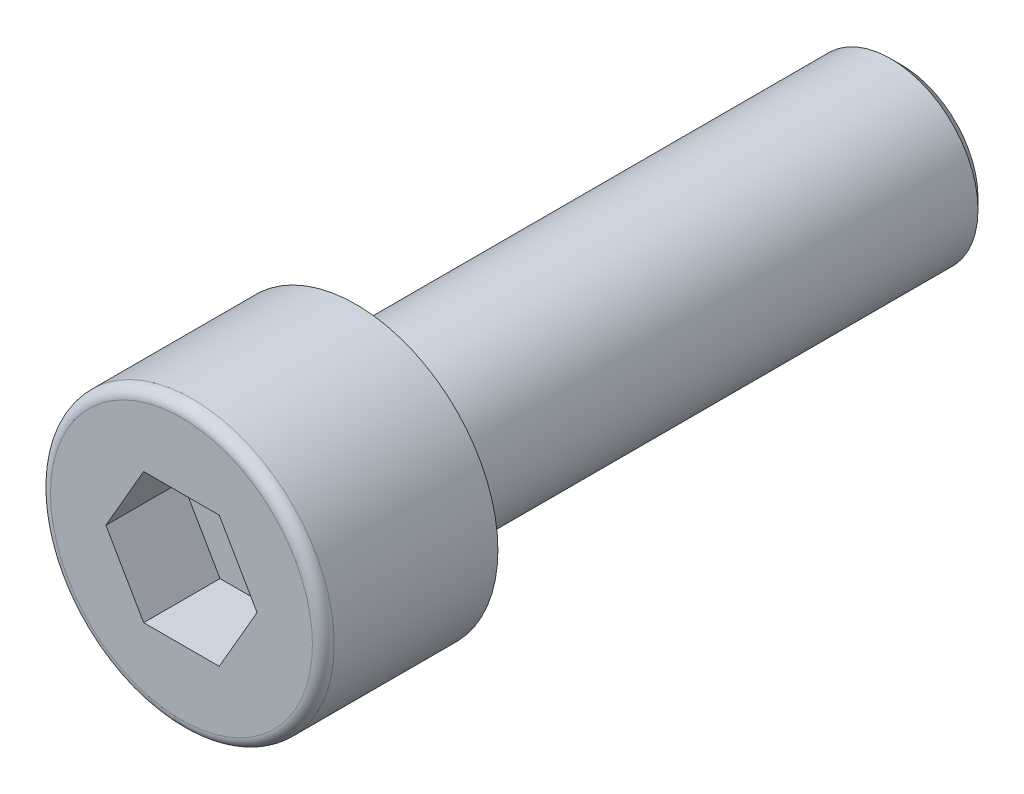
ISO-10303-21;
HEADER;
FILE_DESCRIPTION(('STEP AP214'),'2;1');
FILE_NAME('part.step','',(''),(''),'','','');
FILE_SCHEMA(('AUTOMOTIVE_DESIGN { 1 0 10303 214 1 1 1 1 }'));
ENDSEC;
DATA;
#1=APPLICATION_CONTEXT('core data for automotive mechanical design processes');
#2=APPLICATION_PROTOCOL_DEFINITION('international standard','automotive_design',2000,#1);
#3=PRODUCT_CONTEXT('',#1,'mechanical');
#4=PRODUCT('Part','Part','',(#3));
#5=PRODUCT_RELATED_PRODUCT_CATEGORY('part','',(#4));
#6=PRODUCT_DEFINITION_FORMATION('','',#4);
#7=PRODUCT_DEFINITION_CONTEXT('part definition',#1,'design');
#8=PRODUCT_DEFINITION('design','',#6,#7);
#9=PRODUCT_DEFINITION_SHAPE('','',#8);
#10=(LENGTH_UNIT() NAMED_UNIT(*) SI_UNIT(.MILLI.,.METRE.));
#11=(NAMED_UNIT(*) PLANE_ANGLE_UNIT() SI_UNIT($,.RADIAN.));
#12=(NAMED_UNIT(*) SI_UNIT($,.STERADIAN.) SOLID_ANGLE_UNIT());
#13=UNCERTAINTY_MEASURE_WITH_UNIT(LENGTH_MEASURE(1.E-05),#10,'distance_accuracy_value','');
#14=(GEOMETRIC_REPRESENTATION_CONTEXT(3) GLOBAL_UNCERTAINTY_ASSIGNED_CONTEXT((#13)) GLOBAL_UNIT_ASSIGNED_CONTEXT((#10,
#11,#12)) REPRESENTATION_CONTEXT('',''));
#15=CARTESIAN_POINT('',(0.,0.,0.));
#16=DIRECTION('',(0.,0.,1.));
#17=DIRECTION('',(1.,0.,0.));
#18=AXIS2_PLACEMENT_3D('',#15,#16,#17);
#19=CARTESIAN_POINT('',(0.,0.,25.));
#20=DIRECTION('',(0.,0.,-1.));
#21=DIRECTION('',(-1.,0.,0.));
#22=AXIS2_PLACEMENT_3D('',#19,#20,#21);
#23=CYLINDRICAL_SURFACE('',#22,4.);
#24=CARTESIAN_POINT('',(0.,0.,0.500000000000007));
#25=DIRECTION('',(0.,0.,1.));
#26=DIRECTION('',(1.,0.,0.));
#27=AXIS2_PLACEMENT_3D('',#24,#25,#26);
#28=CIRCLE('',#27,4.);
#29=CARTESIAN_POINT('',(4.,0.,0.500000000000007));
#30=VERTEX_POINT('',#29);
#31=EDGE_CURVE('E39',#30,#30,#28,.T.);
#32=ORIENTED_EDGE('',*,*,#31,.T.);
#33=EDGE_LOOP('',(#32));
#34=FACE_BOUND('',#33,.T.);
#35=CARTESIAN_POINT('',(0.,0.,25.));
#36=DIRECTION('',(0.,0.,1.));
#37=DIRECTION('',(1.,0.,0.));
#38=AXIS2_PLACEMENT_3D('',#35,#36,#37);
#39=CIRCLE('',#38,4.);
#40=CARTESIAN_POINT('',(4.,0.,25.));
#41=VERTEX_POINT('',#40);
#42=EDGE_CURVE('E142',#41,#41,#39,.T.);
#43=ORIENTED_EDGE('',*,*,#42,.F.);
#44=EDGE_LOOP('',(#43));
#45=FACE_BOUND('',#44,.T.);
#46=ADVANCED_FACE('F32',(#34,#45),#23,.T.);
#47=CARTESIAN_POINT('',(0.,0.,0.));
#48=DIRECTION('',(0.,0.,1.));
#49=DIRECTION('',(1.,0.,0.));
#50=AXIS2_PLACEMENT_3D('',#47,#48,#49);
#51=PLANE('',#50);
#52=CARTESIAN_POINT('',(0.,0.,0.));
#53=DIRECTION('',(0.,0.,1.));
#54=DIRECTION('',(1.,0.,0.));
#55=AXIS2_PLACEMENT_3D('',#52,#53,#54);
#56=CIRCLE('',#55,3.5);
#57=CARTESIAN_POINT('',(3.5,0.,0.));
#58=VERTEX_POINT('',#57);
#59=EDGE_CURVE('E11',#58,#58,#56,.F.);
#60=ORIENTED_EDGE('',*,*,#59,.T.);
#61=EDGE_LOOP('',(#60));
#62=FACE_BOUND('',#61,.T.);
#63=ADVANCED_FACE('F168',(#62),#51,.F.);
#64=CARTESIAN_POINT('',(0.,0.,25.));
#65=DIRECTION('',(0.,0.,1.));
#66=DIRECTION('',(1.,0.,0.));
#67=AXIS2_PLACEMENT_3D('',#64,#65,#66);
#68=PLANE('',#67);
#69=CARTESIAN_POINT('',(0.,0.,25.));
#70=DIRECTION('',(0.,0.,1.));
#71=DIRECTION('',(1.,0.,0.));
#72=AXIS2_PLACEMENT_3D('',#69,#70,#71);
#73=CIRCLE('',#72,6.5);
#74=CARTESIAN_POINT('',(6.5,0.,25.));
#75=VERTEX_POINT('',#74);
#76=EDGE_CURVE('E133',#75,#75,#73,.T.);
#77=ORIENTED_EDGE('',*,*,#76,.F.);
#78=EDGE_LOOP('',(#77));
#79=FACE_BOUND('',#78,.T.);
#80=ORIENTED_EDGE('',*,*,#42,.T.);
#81=EDGE_LOOP('',(#80));
#82=FACE_BOUND('',#81,.T.);
#83=ADVANCED_FACE('F172',(#79,#82),#68,.F.);
#84=CARTESIAN_POINT('',(0.,0.,33.));
#85=DIRECTION('',(0.,0.,-1.));
#86=DIRECTION('',(-1.,0.,0.));
#87=AXIS2_PLACEMENT_3D('',#84,#85,#86);
#88=CYLINDRICAL_SURFACE('',#87,6.5);
#89=CARTESIAN_POINT('',(0.,0.,32.5));
#90=DIRECTION('',(0.,0.,1.));
#91=DIRECTION('',(1.,0.,0.));
#92=AXIS2_PLACEMENT_3D('',#89,#90,#91);
#93=CIRCLE('',#92,6.5);
#94=CARTESIAN_POINT('',(6.5,0.,32.5));
#95=VERTEX_POINT('',#94);
#96=EDGE_CURVE('E148',#95,#95,#93,.F.);
#97=ORIENTED_EDGE('',*,*,#96,.T.);
#98=EDGE_LOOP('',(#97));
#99=FACE_BOUND('',#98,.T.);
#100=ORIENTED_EDGE('',*,*,#76,.T.);
#101=EDGE_LOOP('',(#100));
#102=FACE_BOUND('',#101,.T.);
#103=ADVANCED_FACE('F177',(#99,#102),#88,.T.);
#104=CARTESIAN_POINT('',(0.,0.,33.));
#105=DIRECTION('',(0.,0.,1.));
#106=DIRECTION('',(1.,0.,0.));
#107=AXIS2_PLACEMENT_3D('',#104,#105,#106);
#108=PLANE('',#107);
#109=CARTESIAN_POINT('',(0.,0.,33.));
#110=DIRECTION('',(0.,0.,1.));
#111=DIRECTION('',(1.,0.,0.));
#112=AXIS2_PLACEMENT_3D('',#109,#110,#111);
#113=CIRCLE('',#112,6.);
#114=CARTESIAN_POINT('',(6.,0.,33.));
#115=VERTEX_POINT('',#114);
#116=EDGE_CURVE('E145',#115,#115,#113,.T.);
#117=ORIENTED_EDGE('',*,*,#116,.T.);
#118=EDGE_LOOP('',(#117));
#119=FACE_BOUND('',#118,.T.);
#120=DIRECTION('',(0.5,0.866025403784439,0.));
#121=VECTOR('',#120,1.);
#122=CARTESIAN_POINT('',(3.46410161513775,0.,33.));
#123=LINE('',#122,#121);
#124=CARTESIAN_POINT('',(1.73205080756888,-3.,33.));
#125=VERTEX_POINT('',#124);
#126=CARTESIAN_POINT('',(3.46410161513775,0.,33.));
#127=VERTEX_POINT('',#126);
#128=EDGE_CURVE('E46',#125,#127,#123,.T.);
#129=ORIENTED_EDGE('',*,*,#128,.F.);
#130=DIRECTION('',(1.,0.,0.));
#131=VECTOR('',#130,1.);
#132=CARTESIAN_POINT('',(-1.73205080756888,-3.,33.));
#133=LINE('',#132,#131);
#134=CARTESIAN_POINT('',(-1.73205080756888,-3.,33.));
#135=VERTEX_POINT('',#134);
#136=EDGE_CURVE('E115',#135,#125,#133,.T.);
#137=ORIENTED_EDGE('',*,*,#136,.F.);
#138=DIRECTION('',(0.5,-0.866025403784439,0.));
#139=VECTOR('',#138,1.);
#140=CARTESIAN_POINT('',(-3.46410161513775,0.,33.));
#141=LINE('',#140,#139);
#142=CARTESIAN_POINT('',(-3.46410161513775,0.,33.));
#143=VERTEX_POINT('',#142);
#144=EDGE_CURVE('E109',#143,#135,#141,.T.);
#145=ORIENTED_EDGE('',*,*,#144,.F.);
#146=DIRECTION('',(-0.5,-0.866025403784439,0.));
#147=VECTOR('',#146,1.);
#148=CARTESIAN_POINT('',(-3.46410161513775,0.,33.));
#149=LINE('',#148,#147);
#150=CARTESIAN_POINT('',(-1.73205080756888,3.,33.));
#151=VERTEX_POINT('',#150);
#152=EDGE_CURVE('E107',#151,#143,#149,.T.);
#153=ORIENTED_EDGE('',*,*,#152,.F.);
#154=DIRECTION('',(-1.,0.,0.));
#155=VECTOR('',#154,1.);
#156=CARTESIAN_POINT('',(-1.73205080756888,3.,33.));
#157=LINE('',#156,#155);
#158=CARTESIAN_POINT('',(1.73205080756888,3.,33.));
#159=VERTEX_POINT('',#158);
#160=EDGE_CURVE('E89',#159,#151,#157,.T.);
#161=ORIENTED_EDGE('',*,*,#160,.F.);
#162=DIRECTION('',(-0.5,0.866025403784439,0.));
#163=VECTOR('',#162,1.);
#164=CARTESIAN_POINT('',(3.46410161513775,0.,33.));
#165=LINE('',#164,#163);
#166=EDGE_CURVE('E100',#127,#159,#165,.T.);
#167=ORIENTED_EDGE('',*,*,#166,.F.);
#168=EDGE_LOOP('',(#129,#137,#145,#153,#161,#167));
#169=FACE_BOUND('',#168,.T.);
#170=ADVANCED_FACE('F104',(#119,#169),#108,.T.);
#171=CARTESIAN_POINT('',(3.46410161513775,0.,29.5));
#172=DIRECTION('',(0.866025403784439,-0.5,0.));
#173=DIRECTION('',(0.5,0.866025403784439,0.));
#174=AXIS2_PLACEMENT_3D('',#171,#172,#173);
#175=PLANE('',#174);
#176=ORIENTED_EDGE('',*,*,#128,.T.);
#177=DIRECTION('',(0.,0.,1.));
#178=VECTOR('',#177,1.);
#179=CARTESIAN_POINT('',(3.46410161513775,0.,29.5));
#180=LINE('',#179,#178);
#181=CARTESIAN_POINT('',(3.46410161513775,0.,29.5));
#182=VERTEX_POINT('',#181);
#183=EDGE_CURVE('E97',#182,#127,#180,.T.);
#184=ORIENTED_EDGE('',*,*,#183,.F.);
#185=DIRECTION('',(0.5,0.866025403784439,0.));
#186=VECTOR('',#185,1.);
#187=CARTESIAN_POINT('',(3.46410161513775,0.,29.5));
#188=LINE('',#187,#186);
#189=CARTESIAN_POINT('',(1.73205080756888,-3.,29.5));
#190=VERTEX_POINT('',#189);
#191=EDGE_CURVE('E117',#190,#182,#188,.T.);
#192=ORIENTED_EDGE('',*,*,#191,.F.);
#193=DIRECTION('',(0.,0.,1.));
#194=VECTOR('',#193,1.);
#195=CARTESIAN_POINT('',(1.73205080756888,-3.,29.5));
#196=LINE('',#195,#194);
#197=EDGE_CURVE('E53',#190,#125,#196,.T.);
#198=ORIENTED_EDGE('',*,*,#197,.T.);
#199=EDGE_LOOP('',(#176,#184,#192,#198));
#200=FACE_BOUND('',#199,.T.);
#201=ADVANCED_FACE('F185',(#200),#175,.F.);
#202=CARTESIAN_POINT('',(-1.73205080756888,-3.,29.5));
#203=DIRECTION('',(0.,-1.,0.));
#204=DIRECTION('',(0.,0.,-1.));
#205=AXIS2_PLACEMENT_3D('',#202,#203,#204);
#206=PLANE('',#205);
#207=ORIENTED_EDGE('',*,*,#136,.T.);
#208=ORIENTED_EDGE('',*,*,#197,.F.);
#209=DIRECTION('',(1.,0.,0.));
#210=VECTOR('',#209,1.);
#211=CARTESIAN_POINT('',(-1.73205080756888,-3.,29.5));
#212=LINE('',#211,#210);
#213=CARTESIAN_POINT('',(-1.73205080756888,-3.,29.5));
#214=VERTEX_POINT('',#213);
#215=EDGE_CURVE('E129',#214,#190,#212,.T.);
#216=ORIENTED_EDGE('',*,*,#215,.F.);
#217=DIRECTION('',(0.,0.,1.));
#218=VECTOR('',#217,1.);
#219=CARTESIAN_POINT('',(-1.73205080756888,-3.,29.5));
#220=LINE('',#219,#218);
#221=EDGE_CURVE('E134',#214,#135,#220,.T.);
#222=ORIENTED_EDGE('',*,*,#221,.T.);
#223=EDGE_LOOP('',(#207,#208,#216,#222));
#224=FACE_BOUND('',#223,.T.);
#225=ADVANCED_FACE('F190',(#224),#206,.F.);
#226=CARTESIAN_POINT('',(-3.46410161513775,0.,29.5));
#227=DIRECTION('',(-0.866025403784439,-0.5,0.));
#228=DIRECTION('',(0.5,-0.866025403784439,0.));
#229=AXIS2_PLACEMENT_3D('',#226,#227,#228);
#230=PLANE('',#229);
#231=ORIENTED_EDGE('',*,*,#144,.T.);
#232=ORIENTED_EDGE('',*,*,#221,.F.);
#233=DIRECTION('',(0.5,-0.866025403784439,0.));
#234=VECTOR('',#233,1.);
#235=CARTESIAN_POINT('',(-3.46410161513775,0.,29.5));
#236=LINE('',#235,#234);
#237=CARTESIAN_POINT('',(-3.46410161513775,0.,29.5));
#238=VERTEX_POINT('',#237);
#239=EDGE_CURVE('E126',#238,#214,#236,.T.);
#240=ORIENTED_EDGE('',*,*,#239,.F.);
#241=DIRECTION('',(0.,0.,1.));
#242=VECTOR('',#241,1.);
#243=CARTESIAN_POINT('',(-3.46410161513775,0.,29.5));
#244=LINE('',#243,#242);
#245=EDGE_CURVE('E136',#238,#143,#244,.T.);
#246=ORIENTED_EDGE('',*,*,#245,.T.);
#247=EDGE_LOOP('',(#231,#232,#240,#246));
#248=FACE_BOUND('',#247,.T.);
#249=ADVANCED_FACE('F198',(#248),#230,.F.);
#250=CARTESIAN_POINT('',(-3.46410161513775,0.,29.5));
#251=DIRECTION('',(-0.866025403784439,0.5,0.));
#252=DIRECTION('',(-0.5,-0.866025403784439,0.));
#253=AXIS2_PLACEMENT_3D('',#250,#251,#252);
#254=PLANE('',#253);
#255=ORIENTED_EDGE('',*,*,#152,.T.);
#256=ORIENTED_EDGE('',*,*,#245,.F.);
#257=DIRECTION('',(-0.5,-0.866025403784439,0.));
#258=VECTOR('',#257,1.);
#259=CARTESIAN_POINT('',(-3.46410161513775,0.,29.5));
#260=LINE('',#259,#258);
#261=CARTESIAN_POINT('',(-1.73205080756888,3.,29.5));
#262=VERTEX_POINT('',#261);
#263=EDGE_CURVE('E123',#262,#238,#260,.T.);
#264=ORIENTED_EDGE('',*,*,#263,.F.);
#265=DIRECTION('',(0.,0.,1.));
#266=VECTOR('',#265,1.);
#267=CARTESIAN_POINT('',(-1.73205080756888,3.,29.5));
#268=LINE('',#267,#266);
#269=EDGE_CURVE('E96',#262,#151,#268,.T.);
#270=ORIENTED_EDGE('',*,*,#269,.T.);
#271=EDGE_LOOP('',(#255,#256,#264,#270));
#272=FACE_BOUND('',#271,.T.);
#273=ADVANCED_FACE('F195',(#272),#254,.F.);
#274=CARTESIAN_POINT('',(-1.73205080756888,3.,29.5));
#275=DIRECTION('',(0.,1.,0.));
#276=DIRECTION('',(0.,0.,1.));
#277=AXIS2_PLACEMENT_3D('',#274,#275,#276);
#278=PLANE('',#277);
#279=ORIENTED_EDGE('',*,*,#160,.T.);
#280=ORIENTED_EDGE('',*,*,#269,.F.);
#281=DIRECTION('',(-1.,0.,0.));
#282=VECTOR('',#281,1.);
#283=CARTESIAN_POINT('',(-1.73205080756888,3.,29.5));
#284=LINE('',#283,#282);
#285=CARTESIAN_POINT('',(1.73205080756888,3.,29.5));
#286=VERTEX_POINT('',#285);
#287=EDGE_CURVE('E92',#286,#262,#284,.T.);
#288=ORIENTED_EDGE('',*,*,#287,.F.);
#289=DIRECTION('',(0.,0.,1.));
#290=VECTOR('',#289,1.);
#291=CARTESIAN_POINT('',(1.73205080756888,3.,29.5));
#292=LINE('',#291,#290);
#293=EDGE_CURVE('E85',#286,#159,#292,.T.);
#294=ORIENTED_EDGE('',*,*,#293,.T.);
#295=EDGE_LOOP('',(#279,#280,#288,#294));
#296=FACE_BOUND('',#295,.T.);
#297=ADVANCED_FACE('F87',(#296),#278,.F.);
#298=CARTESIAN_POINT('',(3.46410161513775,0.,29.5));
#299=DIRECTION('',(0.866025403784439,0.5,0.));
#300=DIRECTION('',(-0.5,0.866025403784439,0.));
#301=AXIS2_PLACEMENT_3D('',#298,#299,#300);
#302=PLANE('',#301);
#303=ORIENTED_EDGE('',*,*,#166,.T.);
#304=ORIENTED_EDGE('',*,*,#293,.F.);
#305=DIRECTION('',(-0.5,0.866025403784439,0.));
#306=VECTOR('',#305,1.);
#307=CARTESIAN_POINT('',(3.46410161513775,0.,29.5));
#308=LINE('',#307,#306);
#309=EDGE_CURVE('E120',#182,#286,#308,.T.);
#310=ORIENTED_EDGE('',*,*,#309,.F.);
#311=ORIENTED_EDGE('',*,*,#183,.T.);
#312=EDGE_LOOP('',(#303,#304,#310,#311));
#313=FACE_BOUND('',#312,.T.);
#314=ADVANCED_FACE('F101',(#313),#302,.F.);
#315=CARTESIAN_POINT('',(1.73205080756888,-3.,29.5));
#316=DIRECTION('',(0.,0.,1.));
#317=DIRECTION('',(1.,0.,0.));
#318=AXIS2_PLACEMENT_3D('',#315,#316,#317);
#319=PLANE('',#318);
#320=ORIENTED_EDGE('',*,*,#191,.T.);
#321=ORIENTED_EDGE('',*,*,#309,.T.);
#322=ORIENTED_EDGE('',*,*,#287,.T.);
#323=ORIENTED_EDGE('',*,*,#263,.T.);
#324=ORIENTED_EDGE('',*,*,#239,.T.);
#325=ORIENTED_EDGE('',*,*,#215,.T.);
#326=EDGE_LOOP('',(#320,#321,#322,#323,#324,#325));
#327=FACE_BOUND('',#326,.T.);
#328=ADVANCED_FACE('F163',(#327),#319,.T.);
#329=CARTESIAN_POINT('',(0.,0.,32.5));
#330=DIRECTION('',(0.,0.,1.));
#331=DIRECTION('',(1.,0.,0.));
#332=AXIS2_PLACEMENT_3D('',#329,#330,#331);
#333=TOROIDAL_SURFACE('',#332,6.,0.5);
#334=ORIENTED_EDGE('',*,*,#96,.F.);
#335=EDGE_LOOP('',(#334));
#336=FACE_BOUND('',#335,.T.);
#337=ORIENTED_EDGE('',*,*,#116,.F.);
#338=EDGE_LOOP('',(#337));
#339=FACE_BOUND('',#338,.T.);
#340=ADVANCED_FACE('F157',(#336,#339),#333,.T.);
#341=CARTESIAN_POINT('',(0.,0.,0.500000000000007));
#342=DIRECTION('',(0.,0.,1.));
#343=DIRECTION('',(1.,0.,0.));
#344=AXIS2_PLACEMENT_3D('',#341,#342,#343);
#345=CONICAL_SURFACE('',#344,4.,0.785398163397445);
#346=ORIENTED_EDGE('',*,*,#59,.F.);
#347=EDGE_LOOP('',(#346));
#348=FACE_BOUND('',#347,.T.);
#349=ORIENTED_EDGE('',*,*,#31,.F.);
#350=EDGE_LOOP('',(#349));
#351=FACE_BOUND('',#350,.T.);
#352=ADVANCED_FACE('F155',(#348,#351),#345,.T.);
#353=CLOSED_SHELL('',(#46,#63,#83,#103,#170,#201,#225,#249,#273,#297,#314,#328,#340,#352));
#354=MANIFOLD_SOLID_BREP('B2',#353);
#355=ADVANCED_BREP_SHAPE_REPRESENTATION('',(#18,#354),#14);
#356=SHAPE_DEFINITION_REPRESENTATION(#9,#355);
ENDSEC;
END-ISO-10303-21;
